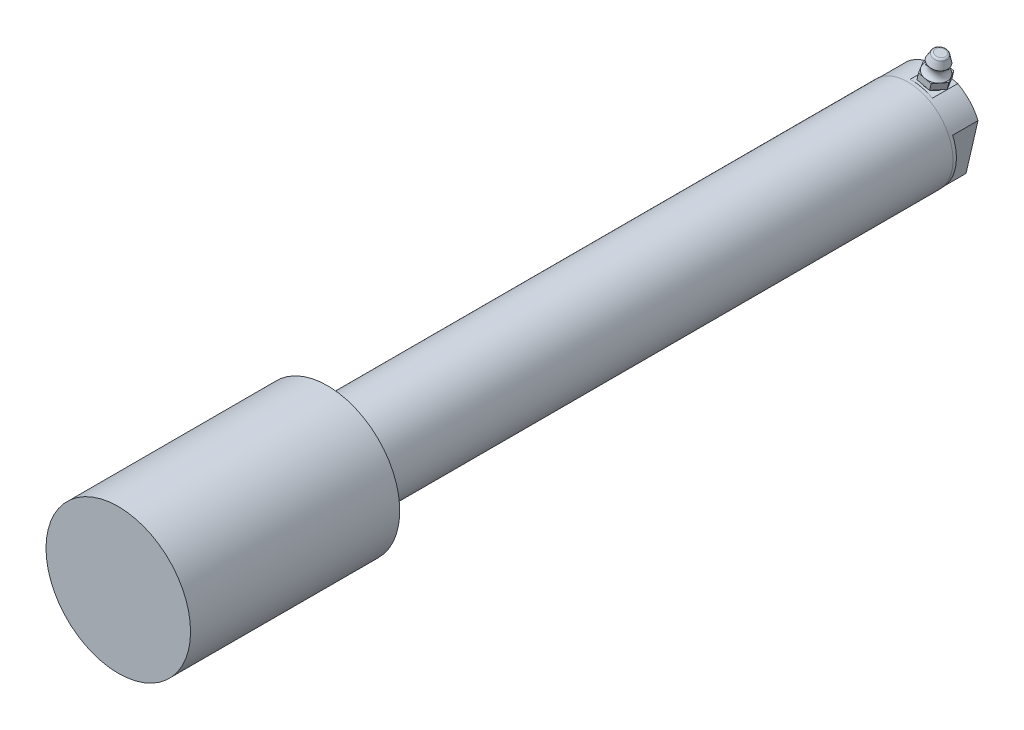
ISO-10303-21;
HEADER;
FILE_DESCRIPTION(('STEP AP214'),'2;1');
FILE_NAME('part.step','',(''),(''),'','','');
FILE_SCHEMA(('AUTOMOTIVE_DESIGN { 1 0 10303 214 1 1 1 1 }'));
ENDSEC;
DATA;
#1=APPLICATION_CONTEXT('core data for automotive mechanical design processes');
#2=APPLICATION_PROTOCOL_DEFINITION('international standard','automotive_design',2000,#1);
#3=PRODUCT_CONTEXT('',#1,'mechanical');
#4=PRODUCT('Part','Part','',(#3));
#5=PRODUCT_RELATED_PRODUCT_CATEGORY('part','',(#4));
#6=PRODUCT_DEFINITION_FORMATION('','',#4);
#7=PRODUCT_DEFINITION_CONTEXT('part definition',#1,'design');
#8=PRODUCT_DEFINITION('design','',#6,#7);
#9=PRODUCT_DEFINITION_SHAPE('','',#8);
#10=(LENGTH_UNIT() NAMED_UNIT(*) SI_UNIT(.MILLI.,.METRE.));
#11=(NAMED_UNIT(*) PLANE_ANGLE_UNIT() SI_UNIT($,.RADIAN.));
#12=(NAMED_UNIT(*) SI_UNIT($,.STERADIAN.) SOLID_ANGLE_UNIT());
#13=UNCERTAINTY_MEASURE_WITH_UNIT(LENGTH_MEASURE(1.E-05),#10,'distance_accuracy_value','');
#14=(GEOMETRIC_REPRESENTATION_CONTEXT(3) GLOBAL_UNCERTAINTY_ASSIGNED_CONTEXT((#13)) GLOBAL_UNIT_ASSIGNED_CONTEXT((#10,
#11,#12)) REPRESENTATION_CONTEXT('',''));
#15=CARTESIAN_POINT('',(0.,0.,0.));
#16=DIRECTION('',(0.,0.,1.));
#17=DIRECTION('',(1.,0.,0.));
#18=AXIS2_PLACEMENT_3D('',#15,#16,#17);
#19=CARTESIAN_POINT('',(2.58904604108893,11.2143904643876,4.445));
#20=DIRECTION('',(0.224951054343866,0.974370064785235,0.));
#21=DIRECTION('',(0.,0.,1.));
#22=AXIS2_PLACEMENT_3D('',#19,#20,#21);
#23=CONICAL_SURFACE('',#22,3.048,0.0447462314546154);
#24=CARTESIAN_POINT('',(3.54610030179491,15.3598479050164,4.445));
#25=DIRECTION('',(-0.224951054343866,-0.974370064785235,0.));
#26=DIRECTION('',(0.,0.,-1.));
#27=AXIS2_PLACEMENT_3D('',#24,#25,#26);
#28=CIRCLE('',#27,3.2385);
#29=CARTESIAN_POINT('',(3.54610030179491,15.3598479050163,7.6835));
#30=VERTEX_POINT('',#29);
#31=EDGE_CURVE('E327',#30,#30,#28,.T.);
#32=CARTESIAN_POINT('',(3.42825406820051,14.849399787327,4.445));
#33=DIRECTION('',(-0.224951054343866,-0.974370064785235,0.));
#34=DIRECTION('',(0.974370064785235,-0.224951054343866,0.));
#35=AXIS2_PLACEMENT_3D('',#32,#33,#34);
#36=CIRCLE('',#35,3.21504291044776);
#37=CARTESIAN_POINT('',(3.42825406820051,14.849399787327,7.66004291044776));
#38=VERTEX_POINT('',#37);
#39=EDGE_CURVE('E10',#38,#38,#36,.T.);
#40=CARTESIAN_POINT('',(3.54610030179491,15.3598479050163,7.6835));
#41=CARTESIAN_POINT('',(3.54487273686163,15.3545307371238,7.68325565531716));
#42=CARTESIAN_POINT('',(3.54364517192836,15.3492135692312,7.68301131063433));
#43=CARTESIAN_POINT('',(3.54119004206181,15.338579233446,7.68252262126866));
#44=CARTESIAN_POINT('',(3.53996247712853,15.3332620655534,7.68227827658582));
#45=CARTESIAN_POINT('',(3.53750734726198,15.3226277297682,7.68178958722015));
#46=CARTESIAN_POINT('',(3.53627978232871,15.3173105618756,7.68154524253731));
#47=CARTESIAN_POINT('',(3.53382465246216,15.3066762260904,7.68105655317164));
#48=CARTESIAN_POINT('',(3.53259708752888,15.3013590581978,7.68081220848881));
#49=CARTESIAN_POINT('',(3.53014195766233,15.2907247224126,7.68032351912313));
#50=CARTESIAN_POINT('',(3.52891439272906,15.28540755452,7.6800791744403));
#51=CARTESIAN_POINT('',(3.52645926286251,15.2747732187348,7.67959048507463));
#52=CARTESIAN_POINT('',(3.52523169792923,15.2694560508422,7.67934614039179));
#53=CARTESIAN_POINT('',(3.52277656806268,15.258821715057,7.67885745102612));
#54=CARTESIAN_POINT('',(3.52154900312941,15.2535045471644,7.67861310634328));
#55=CARTESIAN_POINT('',(3.51909387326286,15.2428702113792,7.67812441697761));
#56=CARTESIAN_POINT('',(3.51786630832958,15.2375530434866,7.67788007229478));
#57=CARTESIAN_POINT('',(3.51541117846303,15.2269187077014,7.6773913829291));
#58=CARTESIAN_POINT('',(3.51418361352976,15.2216015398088,7.67714703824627));
#59=CARTESIAN_POINT('',(3.51172848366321,15.2109672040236,7.6766583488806));
#60=CARTESIAN_POINT('',(3.51050091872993,15.205650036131,7.67641400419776));
#61=CARTESIAN_POINT('',(3.50804578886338,15.1950157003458,7.67592531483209));
#62=CARTESIAN_POINT('',(3.50681822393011,15.1896985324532,7.67568097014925));
#63=CARTESIAN_POINT('',(3.50436309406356,15.179064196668,7.67519228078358));
#64=CARTESIAN_POINT('',(3.50313552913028,15.1737470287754,7.67494793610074));
#65=CARTESIAN_POINT('',(3.50068039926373,15.1631126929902,7.67445924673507));
#66=CARTESIAN_POINT('',(3.49945283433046,15.1577955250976,7.67421490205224));
#67=CARTESIAN_POINT('',(3.49699770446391,15.1471611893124,7.67372621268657));
#68=CARTESIAN_POINT('',(3.49577013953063,15.1418440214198,7.67348186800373));
#69=CARTESIAN_POINT('',(3.49331500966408,15.1312096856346,7.67299317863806));
#70=CARTESIAN_POINT('',(3.49208744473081,15.125892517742,7.67274883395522));
#71=CARTESIAN_POINT('',(3.48963231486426,15.1152581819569,7.67226014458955));
#72=CARTESIAN_POINT('',(3.48840474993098,15.1099410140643,7.67201579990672));
#73=CARTESIAN_POINT('',(3.48594962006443,15.0993066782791,7.67152711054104));
#74=CARTESIAN_POINT('',(3.48472205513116,15.0939895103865,7.67128276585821));
#75=CARTESIAN_POINT('',(3.48226692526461,15.0833551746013,7.67079407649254));
#76=CARTESIAN_POINT('',(3.48103936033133,15.0780380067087,7.6705497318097));
#77=CARTESIAN_POINT('',(3.47858423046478,15.0674036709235,7.67006104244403));
#78=CARTESIAN_POINT('',(3.47735666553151,15.0620865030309,7.66981669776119));
#79=CARTESIAN_POINT('',(3.47490153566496,15.0514521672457,7.66932800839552));
#80=CARTESIAN_POINT('',(3.47367397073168,15.0461349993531,7.66908366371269));
#81=CARTESIAN_POINT('',(3.47121884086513,15.0355006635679,7.66859497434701));
#82=CARTESIAN_POINT('',(3.46999127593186,15.0301834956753,7.66835062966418));
#83=CARTESIAN_POINT('',(3.46753614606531,15.0195491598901,7.66786194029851));
#84=CARTESIAN_POINT('',(3.46630858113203,15.0142319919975,7.66761759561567));
#85=CARTESIAN_POINT('',(3.46385345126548,15.0035976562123,7.66712890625));
#86=CARTESIAN_POINT('',(3.46262588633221,14.9982804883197,7.66688456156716));
#87=CARTESIAN_POINT('',(3.46017075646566,14.9876461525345,7.66639587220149));
#88=CARTESIAN_POINT('',(3.45894319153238,14.9823289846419,7.66615152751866));
#89=CARTESIAN_POINT('',(3.45648806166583,14.9716946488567,7.66566283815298));
#90=CARTESIAN_POINT('',(3.45526049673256,14.9663774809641,7.66541849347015));
#91=CARTESIAN_POINT('',(3.45280536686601,14.9557431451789,7.66492980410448));
#92=CARTESIAN_POINT('',(3.45157780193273,14.9504259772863,7.66468545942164));
#93=CARTESIAN_POINT('',(3.44912267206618,14.9397916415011,7.66419677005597));
#94=CARTESIAN_POINT('',(3.44789510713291,14.9344744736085,7.66395242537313));
#95=CARTESIAN_POINT('',(3.44543997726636,14.9238401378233,7.66346373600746));
#96=CARTESIAN_POINT('',(3.44421241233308,14.9185229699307,7.66321939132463));
#97=CARTESIAN_POINT('',(3.44175728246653,14.9078886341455,7.66273070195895));
#98=CARTESIAN_POINT('',(3.44052971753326,14.9025714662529,7.66248635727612));
#99=CARTESIAN_POINT('',(3.43807458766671,14.8919371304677,7.66199766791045));
#100=CARTESIAN_POINT('',(3.43684702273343,14.8866199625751,7.66175332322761));
#101=CARTESIAN_POINT('',(3.43439189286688,14.8759856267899,7.66126463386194));
#102=CARTESIAN_POINT('',(3.43316432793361,14.8706684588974,7.6610202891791));
#103=CARTESIAN_POINT('',(3.43070919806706,14.8600341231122,7.66053159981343));
#104=CARTESIAN_POINT('',(3.42948163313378,14.8547169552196,7.6602872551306));
#105=CARTESIAN_POINT('',(3.42825406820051,14.849399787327,7.66004291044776));
#106=B_SPLINE_CURVE_WITH_KNOTS('',3,(#40,#41,#42,#43,#44,#45,#46,#47,#48,#49,#50,#51,#52,#53,
#54,#55,#56,#57,#58,#59,#60,#61,#62,#63,#64,#65,#66,#67,#68,#69,#70,#71,#72,#73,#74,#75,#76,#77,
#78,#79,#80,#81,#82,#83,#84,#85,#86,#87,#88,#89,#90,#91,#92,#93,#94,#95,#96,#97,#98,#99,#100,
#101,#102,#103,#104,#105),.UNSPECIFIED.,.F.,.F.,(4,2,2,2,2,2,2,2,2,2,2,2,2,2,2,2,2,2,2,2,2,2,2,
2,2,2,2,2,2,2,2,2,4),(0.,0.0163874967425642,0.03277499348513,0.0491624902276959,
0.0655499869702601,0.081937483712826,0.0983249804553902,0.114712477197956,0.131099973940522,
0.147487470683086,0.163874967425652,0.180262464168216,0.196649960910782,0.213037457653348,
0.229424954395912,0.245812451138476,0.262199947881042,0.278587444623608,0.294974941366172,
0.311362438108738,0.327749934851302,0.344137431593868,0.360524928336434,0.376912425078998,
0.393299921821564,0.409687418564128,0.426074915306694,0.44246241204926,0.458849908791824,
0.47523740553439,0.491624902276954,0.50801239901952,0.524399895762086),.UNSPECIFIED.);
#107=EDGE_CURVE('BSEAM16',#30,#38,#106,.T.);
#108=ORIENTED_EDGE('',*,*,#31,.T.);
#109=ORIENTED_EDGE('',*,*,#39,.F.);
#110=ORIENTED_EDGE('',*,*,#107,.T.);
#111=ORIENTED_EDGE('',*,*,#107,.F.);
#112=EDGE_LOOP('',(#108,#110,#109,#111));
#113=FACE_BOUND('',#112,.T.);
#114=ADVANCED_FACE('F16',(#113),#23,.T.);
#115=CARTESIAN_POINT('',(1.96340863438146,18.6904902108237,0.47625));
#116=DIRECTION('',(0.224951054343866,0.974370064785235,0.));
#117=DIRECTION('',(0.974370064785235,-0.224951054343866,0.));
#118=AXIS2_PLACEMENT_3D('',#115,#116,#117);
#119=PLANE('',#118);
#120=CARTESIAN_POINT('',(4.19604013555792,18.1750466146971,4.445));
#121=DIRECTION('',(-0.224951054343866,-0.974370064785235,0.));
#122=DIRECTION('',(0.,0.,-1.));
#123=AXIS2_PLACEMENT_3D('',#120,#121,#122);
#124=CIRCLE('',#123,3.96875);
#125=CARTESIAN_POINT('',(4.19604013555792,18.1750466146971,8.41375));
#126=VERTEX_POINT('',#125);
#127=CARTESIAN_POINT('',(0.847092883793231,18.9482120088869,6.429375));
#128=VERTEX_POINT('',#127);
#129=EDGE_CURVE('E412',#126,#128,#124,.T.);
#130=ORIENTED_EDGE('',*,*,#129,.T.);
#131=DIRECTION('',(0.487185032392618,-0.112475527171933,0.866025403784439));
#132=VECTOR('',#131,1.);
#133=CARTESIAN_POINT('',(-0.269222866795,19.2059338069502,4.445));
#134=LINE('',#133,#132);
#135=CARTESIAN_POINT('',(1.96340863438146,18.6904902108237,8.41375));
#136=VERTEX_POINT('',#135);
#137=EDGE_CURVE('E390',#128,#136,#134,.T.);
#138=ORIENTED_EDGE('',*,*,#137,.T.);
#139=DIRECTION('',(0.974370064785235,-0.224951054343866,0.));
#140=VECTOR('',#139,1.);
#141=CARTESIAN_POINT('',(1.96340863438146,18.6904902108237,8.41375));
#142=LINE('',#141,#140);
#143=EDGE_CURVE('E394',#136,#126,#142,.T.);
#144=ORIENTED_EDGE('',*,*,#143,.T.);
#145=EDGE_LOOP('',(#130,#138,#144));
#146=FACE_BOUND('',#145,.T.);
#147=ADVANCED_FACE('F269',(#146),#119,.T.);
#148=CARTESIAN_POINT('',(7.54498738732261,17.4018812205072,6.429375));
#149=VERTEX_POINT('',#148);
#150=EDGE_CURVE('E411',#149,#126,#124,.T.);
#151=ORIENTED_EDGE('',*,*,#150,.T.);
#152=CARTESIAN_POINT('',(6.42867163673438,17.6596030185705,8.41375));
#153=VERTEX_POINT('',#152);
#154=EDGE_CURVE('E393',#126,#153,#142,.T.);
#155=ORIENTED_EDGE('',*,*,#154,.T.);
#156=DIRECTION('',(0.487185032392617,-0.112475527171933,-0.866025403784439));
#157=VECTOR('',#156,1.);
#158=CARTESIAN_POINT('',(6.42867163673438,17.6596030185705,8.41375));
#159=LINE('',#158,#157);
#160=EDGE_CURVE('E397',#153,#149,#159,.T.);
#161=ORIENTED_EDGE('',*,*,#160,.T.);
#162=EDGE_LOOP('',(#151,#155,#161));
#163=FACE_BOUND('',#162,.T.);
#164=ADVANCED_FACE('F426',(#163),#119,.T.);
#165=CARTESIAN_POINT('',(7.54498738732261,17.4018812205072,2.460625));
#166=VERTEX_POINT('',#165);
#167=EDGE_CURVE('E94',#166,#149,#124,.T.);
#168=ORIENTED_EDGE('',*,*,#167,.T.);
#169=CARTESIAN_POINT('',(8.66130313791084,17.144159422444,4.445));
#170=VERTEX_POINT('',#169);
#171=EDGE_CURVE('E396',#149,#170,#159,.T.);
#172=ORIENTED_EDGE('',*,*,#171,.T.);
#173=DIRECTION('',(-0.487185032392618,0.112475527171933,-0.866025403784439));
#174=VECTOR('',#173,1.);
#175=CARTESIAN_POINT('',(8.66130313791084,17.144159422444,4.445));
#176=LINE('',#175,#174);
#177=EDGE_CURVE('E335',#170,#166,#176,.T.);
#178=ORIENTED_EDGE('',*,*,#177,.T.);
#179=EDGE_LOOP('',(#168,#172,#178));
#180=FACE_BOUND('',#179,.T.);
#181=ADVANCED_FACE('F404',(#180),#119,.T.);
#182=CARTESIAN_POINT('',(4.19604013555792,18.1750466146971,0.47625));
#183=VERTEX_POINT('',#182);
#184=EDGE_CURVE('E101',#183,#166,#124,.T.);
#185=ORIENTED_EDGE('',*,*,#184,.T.);
#186=CARTESIAN_POINT('',(6.42867163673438,17.6596030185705,0.47625));
#187=VERTEX_POINT('',#186);
#188=EDGE_CURVE('E399',#166,#187,#176,.T.);
#189=ORIENTED_EDGE('',*,*,#188,.T.);
#190=DIRECTION('',(-0.974370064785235,0.224951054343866,0.));
#191=VECTOR('',#190,1.);
#192=CARTESIAN_POINT('',(6.42867163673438,17.6596030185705,0.47625));
#193=LINE('',#192,#191);
#194=EDGE_CURVE('E384',#187,#183,#193,.T.);
#195=ORIENTED_EDGE('',*,*,#194,.T.);
#196=EDGE_LOOP('',(#185,#189,#195));
#197=FACE_BOUND('',#196,.T.);
#198=ADVANCED_FACE('F311',(#197),#119,.T.);
#199=CARTESIAN_POINT('',(0.84709288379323,18.9482120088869,2.460625));
#200=VERTEX_POINT('',#199);
#201=EDGE_CURVE('E380',#200,#183,#124,.T.);
#202=ORIENTED_EDGE('',*,*,#201,.T.);
#203=CARTESIAN_POINT('',(1.96340863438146,18.6904902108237,0.47625));
#204=VERTEX_POINT('',#203);
#205=EDGE_CURVE('E345',#183,#204,#193,.T.);
#206=ORIENTED_EDGE('',*,*,#205,.T.);
#207=DIRECTION('',(-0.487185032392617,0.112475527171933,0.866025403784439));
#208=VECTOR('',#207,1.);
#209=CARTESIAN_POINT('',(1.96340863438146,18.6904902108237,0.47625));
#210=LINE('',#209,#208);
#211=EDGE_CURVE('E387',#204,#200,#210,.T.);
#212=ORIENTED_EDGE('',*,*,#211,.T.);
#213=EDGE_LOOP('',(#202,#206,#212));
#214=FACE_BOUND('',#213,.T.);
#215=ADVANCED_FACE('F282',(#214),#119,.T.);
#216=CARTESIAN_POINT('',(6.42867163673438,17.6596030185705,0.47625));
#217=DIRECTION('',(0.,0.,1.));
#218=DIRECTION('',(-0.224951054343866,-0.974370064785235,0.));
#219=AXIS2_PLACEMENT_3D('',#216,#217,#218);
#220=PLANE('',#219);
#221=DIRECTION('',(-0.974370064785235,0.224951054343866,0.));
#222=VECTOR('',#221,1.);
#223=CARTESIAN_POINT('',(5.89300693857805,15.3393843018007,0.47625));
#224=LINE('',#223,#222);
#225=CARTESIAN_POINT('',(5.89300693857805,15.3393843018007,0.47625));
#226=VERTEX_POINT('',#225);
#227=CARTESIAN_POINT('',(1.42774393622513,16.3702714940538,0.47625));
#228=VERTEX_POINT('',#227);
#229=EDGE_CURVE('E317',#226,#228,#224,.T.);
#230=ORIENTED_EDGE('',*,*,#229,.T.);
#231=DIRECTION('',(-0.224951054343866,-0.974370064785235,0.));
#232=VECTOR('',#231,1.);
#233=CARTESIAN_POINT('',(1.96340863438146,18.6904902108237,0.47625));
#234=LINE('',#233,#232);
#235=EDGE_CURVE('E320',#204,#228,#234,.T.);
#236=ORIENTED_EDGE('',*,*,#235,.F.);
#237=ORIENTED_EDGE('',*,*,#205,.F.);
#238=ORIENTED_EDGE('',*,*,#194,.F.);
#239=DIRECTION('',(-0.224951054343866,-0.974370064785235,0.));
#240=VECTOR('',#239,1.);
#241=CARTESIAN_POINT('',(6.42867163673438,17.6596030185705,0.47625));
#242=LINE('',#241,#240);
#243=EDGE_CURVE('E323',#187,#226,#242,.T.);
#244=ORIENTED_EDGE('',*,*,#243,.T.);
#245=EDGE_LOOP('',(#230,#236,#237,#238,#244));
#246=FACE_BOUND('',#245,.T.);
#247=ADVANCED_FACE('F303',(#246),#220,.F.);
#248=CARTESIAN_POINT('',(1.96340863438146,18.6904902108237,0.47625));
#249=DIRECTION('',(0.843829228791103,-0.194813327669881,0.5));
#250=DIRECTION('',(0.487185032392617,-0.112475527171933,-0.866025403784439));
#251=AXIS2_PLACEMENT_3D('',#248,#249,#250);
#252=PLANE('',#251);
#253=DIRECTION('',(-0.487185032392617,0.112475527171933,0.866025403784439));
#254=VECTOR('',#253,1.);
#255=CARTESIAN_POINT('',(1.42774393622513,16.3702714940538,0.47625));
#256=LINE('',#255,#254);
#257=CARTESIAN_POINT('',(-0.804887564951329,16.8857150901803,4.445));
#258=VERTEX_POINT('',#257);
#259=EDGE_CURVE('E326',#228,#258,#256,.T.);
#260=ORIENTED_EDGE('',*,*,#259,.T.);
#261=DIRECTION('',(-0.224951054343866,-0.974370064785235,0.));
#262=VECTOR('',#261,1.);
#263=CARTESIAN_POINT('',(-0.269222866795,19.2059338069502,4.445));
#264=LINE('',#263,#262);
#265=CARTESIAN_POINT('',(-0.269222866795,19.2059338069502,4.445));
#266=VERTEX_POINT('',#265);
#267=EDGE_CURVE('E356',#266,#258,#264,.T.);
#268=ORIENTED_EDGE('',*,*,#267,.F.);
#269=EDGE_CURVE('E386',#200,#266,#210,.T.);
#270=ORIENTED_EDGE('',*,*,#269,.F.);
#271=ORIENTED_EDGE('',*,*,#211,.F.);
#272=ORIENTED_EDGE('',*,*,#235,.T.);
#273=EDGE_LOOP('',(#260,#268,#270,#271,#272));
#274=FACE_BOUND('',#273,.T.);
#275=ADVANCED_FACE('F300',(#274),#252,.F.);
#276=CARTESIAN_POINT('',(-0.269222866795,19.2059338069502,4.445));
#277=DIRECTION('',(0.843829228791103,-0.194813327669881,-0.5));
#278=DIRECTION('',(-0.487185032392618,0.112475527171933,-0.866025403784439));
#279=AXIS2_PLACEMENT_3D('',#276,#277,#278);
#280=PLANE('',#279);
#281=DIRECTION('',(0.487185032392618,-0.112475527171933,0.866025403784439));
#282=VECTOR('',#281,1.);
#283=CARTESIAN_POINT('',(-0.804887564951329,16.8857150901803,4.445));
#284=LINE('',#283,#282);
#285=CARTESIAN_POINT('',(1.42774393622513,16.3702714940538,8.41375));
#286=VERTEX_POINT('',#285);
#287=EDGE_CURVE('E329',#258,#286,#284,.T.);
#288=ORIENTED_EDGE('',*,*,#287,.T.);
#289=DIRECTION('',(-0.224951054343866,-0.974370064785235,0.));
#290=VECTOR('',#289,1.);
#291=CARTESIAN_POINT('',(1.96340863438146,18.6904902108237,8.41375));
#292=LINE('',#291,#290);
#293=EDGE_CURVE('E353',#136,#286,#292,.T.);
#294=ORIENTED_EDGE('',*,*,#293,.F.);
#295=ORIENTED_EDGE('',*,*,#137,.F.);
#296=EDGE_CURVE('E391',#266,#128,#134,.T.);
#297=ORIENTED_EDGE('',*,*,#296,.F.);
#298=ORIENTED_EDGE('',*,*,#267,.T.);
#299=EDGE_LOOP('',(#288,#294,#295,#297,#298));
#300=FACE_BOUND('',#299,.T.);
#301=ADVANCED_FACE('F296',(#300),#280,.F.);
#302=CARTESIAN_POINT('',(1.96340863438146,18.6904902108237,8.41375));
#303=DIRECTION('',(0.,0.,-1.));
#304=DIRECTION('',(-0.974370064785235,0.224951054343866,0.));
#305=AXIS2_PLACEMENT_3D('',#302,#303,#304);
#306=PLANE('',#305);
#307=DIRECTION('',(0.974370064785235,-0.224951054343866,0.));
#308=VECTOR('',#307,1.);
#309=CARTESIAN_POINT('',(1.42774393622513,16.3702714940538,8.41375));
#310=LINE('',#309,#308);
#311=CARTESIAN_POINT('',(5.89300693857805,15.3393843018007,8.41375));
#312=VERTEX_POINT('',#311);
#313=EDGE_CURVE('E339',#286,#312,#310,.T.);
#314=ORIENTED_EDGE('',*,*,#313,.T.);
#315=DIRECTION('',(-0.224951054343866,-0.974370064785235,0.));
#316=VECTOR('',#315,1.);
#317=CARTESIAN_POINT('',(6.42867163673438,17.6596030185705,8.41375));
#318=LINE('',#317,#316);
#319=EDGE_CURVE('E350',#153,#312,#318,.T.);
#320=ORIENTED_EDGE('',*,*,#319,.F.);
#321=ORIENTED_EDGE('',*,*,#154,.F.);
#322=ORIENTED_EDGE('',*,*,#143,.F.);
#323=ORIENTED_EDGE('',*,*,#293,.T.);
#324=EDGE_LOOP('',(#314,#320,#321,#322,#323));
#325=FACE_BOUND('',#324,.T.);
#326=ADVANCED_FACE('F292',(#325),#306,.F.);
#327=CARTESIAN_POINT('',(6.42867163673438,17.6596030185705,8.41375));
#328=DIRECTION('',(-0.843829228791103,0.194813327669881,-0.5));
#329=DIRECTION('',(-0.487185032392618,0.112475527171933,0.866025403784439));
#330=AXIS2_PLACEMENT_3D('',#327,#328,#329);
#331=PLANE('',#330);
#332=DIRECTION('',(0.487185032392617,-0.112475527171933,-0.866025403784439));
#333=VECTOR('',#332,1.);
#334=CARTESIAN_POINT('',(5.89300693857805,15.3393843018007,8.41375));
#335=LINE('',#334,#333);
#336=CARTESIAN_POINT('',(8.12563843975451,14.8239407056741,4.445));
#337=VERTEX_POINT('',#336);
#338=EDGE_CURVE('E341',#312,#337,#335,.T.);
#339=ORIENTED_EDGE('',*,*,#338,.T.);
#340=DIRECTION('',(-0.224951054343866,-0.974370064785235,0.));
#341=VECTOR('',#340,1.);
#342=CARTESIAN_POINT('',(8.66130313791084,17.144159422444,4.445));
#343=LINE('',#342,#341);
#344=EDGE_CURVE('E347',#170,#337,#343,.T.);
#345=ORIENTED_EDGE('',*,*,#344,.F.);
#346=ORIENTED_EDGE('',*,*,#171,.F.);
#347=ORIENTED_EDGE('',*,*,#160,.F.);
#348=ORIENTED_EDGE('',*,*,#319,.T.);
#349=EDGE_LOOP('',(#339,#345,#346,#347,#348));
#350=FACE_BOUND('',#349,.T.);
#351=ADVANCED_FACE('F288',(#350),#331,.F.);
#352=CARTESIAN_POINT('',(8.66130313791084,17.144159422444,4.445));
#353=DIRECTION('',(-0.843829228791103,0.194813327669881,0.5));
#354=DIRECTION('',(0.487185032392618,-0.112475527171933,0.866025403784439));
#355=AXIS2_PLACEMENT_3D('',#352,#353,#354);
#356=PLANE('',#355);
#357=DIRECTION('',(-0.487185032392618,0.112475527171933,-0.866025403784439));
#358=VECTOR('',#357,1.);
#359=CARTESIAN_POINT('',(8.12563843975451,14.8239407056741,4.445));
#360=LINE('',#359,#358);
#361=EDGE_CURVE('E343',#337,#226,#360,.T.);
#362=ORIENTED_EDGE('',*,*,#361,.T.);
#363=ORIENTED_EDGE('',*,*,#243,.F.);
#364=ORIENTED_EDGE('',*,*,#188,.F.);
#365=ORIENTED_EDGE('',*,*,#177,.F.);
#366=ORIENTED_EDGE('',*,*,#344,.T.);
#367=EDGE_LOOP('',(#362,#363,#364,#365,#366));
#368=FACE_BOUND('',#367,.T.);
#369=ADVANCED_FACE('F280',(#368),#356,.F.);
#370=EDGE_CURVE('E415',#128,#200,#124,.T.);
#371=ORIENTED_EDGE('',*,*,#370,.T.);
#372=ORIENTED_EDGE('',*,*,#269,.T.);
#373=ORIENTED_EDGE('',*,*,#296,.T.);
#374=EDGE_LOOP('',(#371,#372,#373));
#375=FACE_BOUND('',#374,.T.);
#376=ADVANCED_FACE('F277',(#375),#119,.T.);
#377=CARTESIAN_POINT('',(1.42774393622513,16.3702714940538,0.47625));
#378=DIRECTION('',(0.224951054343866,0.974370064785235,0.));
#379=DIRECTION('',(0.974370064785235,-0.224951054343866,0.));
#380=AXIS2_PLACEMENT_3D('',#377,#378,#379);
#381=PLANE('',#380);
#382=CARTESIAN_POINT('',(3.66037543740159,15.8548278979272,4.445));
#383=DIRECTION('',(-0.224951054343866,-0.974370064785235,0.));
#384=DIRECTION('',(0.,0.,-1.));
#385=AXIS2_PLACEMENT_3D('',#382,#383,#384);
#386=CIRCLE('',#385,3.2385);
#387=CARTESIAN_POINT('',(3.66037543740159,15.8548278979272,1.2065));
#388=VERTEX_POINT('',#387);
#389=EDGE_CURVE('E332',#388,#388,#386,.T.);
#390=ORIENTED_EDGE('',*,*,#389,.F.);
#391=EDGE_LOOP('',(#390));
#392=FACE_BOUND('',#391,.T.);
#393=ORIENTED_EDGE('',*,*,#229,.F.);
#394=ORIENTED_EDGE('',*,*,#361,.F.);
#395=ORIENTED_EDGE('',*,*,#338,.F.);
#396=ORIENTED_EDGE('',*,*,#313,.F.);
#397=ORIENTED_EDGE('',*,*,#287,.F.);
#398=ORIENTED_EDGE('',*,*,#259,.F.);
#399=EDGE_LOOP('',(#393,#394,#395,#396,#397,#398));
#400=FACE_BOUND('',#399,.T.);
#401=ADVANCED_FACE('F265',(#392,#400),#381,.F.);
#402=CARTESIAN_POINT('',(3.66037543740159,15.8548278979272,4.445));
#403=DIRECTION('',(-0.224951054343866,-0.974370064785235,0.));
#404=DIRECTION('',(0.,0.,-1.));
#405=AXIS2_PLACEMENT_3D('',#402,#403,#404);
#406=CYLINDRICAL_SURFACE('',#405,3.2385);
#407=ORIENTED_EDGE('',*,*,#389,.T.);
#408=EDGE_LOOP('',(#407));
#409=FACE_BOUND('',#408,.T.);
#410=ORIENTED_EDGE('',*,*,#31,.F.);
#411=EDGE_LOOP('',(#410));
#412=FACE_BOUND('',#411,.T.);
#413=ADVANCED_FACE('F261',(#409,#412),#406,.T.);
#414=CARTESIAN_POINT('',(5.02810596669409,21.7791196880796,4.445));
#415=DIRECTION('',(-0.224951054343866,-0.974370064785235,0.));
#416=DIRECTION('',(0.,0.,-1.));
#417=AXIS2_PLACEMENT_3D('',#414,#415,#416);
#418=CONICAL_SURFACE('',#417,3.3655,0.340381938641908);
#419=CARTESIAN_POINT('',(5.59956971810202,24.2544011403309,4.445));
#420=DIRECTION('',(0.224951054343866,0.974370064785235,0.));
#421=DIRECTION('',(0.,0.,1.));
#422=AXIS2_PLACEMENT_3D('',#419,#420,#421);
#423=CIRCLE('',#422,2.46577800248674);
#424=CARTESIAN_POINT('',(5.59956971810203,24.2544011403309,1.97922199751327));
#425=VERTEX_POINT('',#424);
#426=EDGE_CURVE('E359',#425,#425,#423,.F.);
#427=CARTESIAN_POINT('',(5.02810596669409,21.7791196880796,4.445));
#428=DIRECTION('',(-0.224951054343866,-0.974370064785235,0.));
#429=DIRECTION('',(0.,0.,-1.));
#430=AXIS2_PLACEMENT_3D('',#427,#428,#429);
#431=CIRCLE('',#430,3.3655);
#432=CARTESIAN_POINT('',(5.02810596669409,21.7791196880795,1.0795));
#433=VERTEX_POINT('',#432);
#434=EDGE_CURVE('E377',#433,#433,#431,.T.);
#435=CARTESIAN_POINT('',(5.59956971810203,24.2544011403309,1.97922199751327));
#436=CARTESIAN_POINT('',(5.59361697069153,24.2286169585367,1.96984989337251));
#437=CARTESIAN_POINT('',(5.58766422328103,24.2028327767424,1.96047778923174));
#438=CARTESIAN_POINT('',(5.57575872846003,24.1512644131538,1.94173358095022));
#439=CARTESIAN_POINT('',(5.56980598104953,24.1254802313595,1.93236147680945));
#440=CARTESIAN_POINT('',(5.55790048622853,24.073911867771,1.91361726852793));
#441=CARTESIAN_POINT('',(5.55194773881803,24.0481276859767,1.90424516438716));
#442=CARTESIAN_POINT('',(5.54004224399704,23.9965593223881,1.88550095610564));
#443=CARTESIAN_POINT('',(5.53408949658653,23.9707751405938,1.87612885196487));
#444=CARTESIAN_POINT('',(5.52218400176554,23.9192067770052,1.85738464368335));
#445=CARTESIAN_POINT('',(5.51623125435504,23.893422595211,1.84801253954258));
#446=CARTESIAN_POINT('',(5.50432575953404,23.8418542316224,1.82926833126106));
#447=CARTESIAN_POINT('',(5.49837301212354,23.8160700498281,1.81989622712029));
#448=CARTESIAN_POINT('',(5.48646751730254,23.7645016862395,1.80115201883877));
#449=CARTESIAN_POINT('',(5.48051476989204,23.7387175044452,1.79177991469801));
#450=CARTESIAN_POINT('',(5.46860927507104,23.6871491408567,1.77303570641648));
#451=CARTESIAN_POINT('',(5.46265652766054,23.6613649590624,1.76366360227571));
#452=CARTESIAN_POINT('',(5.45075103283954,23.6097965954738,1.74491939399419));
#453=CARTESIAN_POINT('',(5.44479828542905,23.5840124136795,1.73554728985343));
#454=CARTESIAN_POINT('',(5.43289279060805,23.532444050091,1.7168030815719));
#455=CARTESIAN_POINT('',(5.42694004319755,23.5066598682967,1.70743097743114));
#456=CARTESIAN_POINT('',(5.41503454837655,23.4550915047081,1.68868676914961));
#457=CARTESIAN_POINT('',(5.40908180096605,23.4293073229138,1.67931466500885));
#458=CARTESIAN_POINT('',(5.39717630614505,23.3777389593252,1.66057045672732));
#459=CARTESIAN_POINT('',(5.39122355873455,23.351954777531,1.65119835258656));
#460=CARTESIAN_POINT('',(5.37931806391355,23.3003864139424,1.63245414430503));
#461=CARTESIAN_POINT('',(5.37336531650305,23.2746022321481,1.62308204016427));
#462=CARTESIAN_POINT('',(5.36145982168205,23.2230338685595,1.60433783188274));
#463=CARTESIAN_POINT('',(5.35550707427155,23.1972496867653,1.59496572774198));
#464=CARTESIAN_POINT('',(5.34360157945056,23.1456813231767,1.57622151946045));
#465=CARTESIAN_POINT('',(5.33764883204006,23.1198971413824,1.56684941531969));
#466=CARTESIAN_POINT('',(5.32574333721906,23.0683287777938,1.54810520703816));
#467=CARTESIAN_POINT('',(5.31979058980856,23.0425445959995,1.5387331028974));
#468=CARTESIAN_POINT('',(5.30788509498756,22.990976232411,1.51998889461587));
#469=CARTESIAN_POINT('',(5.30193234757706,22.9651920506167,1.51061679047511));
#470=CARTESIAN_POINT('',(5.29002685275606,22.9136236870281,1.49187258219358));
#471=CARTESIAN_POINT('',(5.28407410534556,22.8878395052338,1.48250047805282));
#472=CARTESIAN_POINT('',(5.27216861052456,22.8362711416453,1.46375626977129));
#473=CARTESIAN_POINT('',(5.26621586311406,22.810486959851,1.45438416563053));
#474=CARTESIAN_POINT('',(5.25431036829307,22.7589185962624,1.435639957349));
#475=CARTESIAN_POINT('',(5.24835762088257,22.7331344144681,1.42626785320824));
#476=CARTESIAN_POINT('',(5.23645212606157,22.6815660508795,1.40752364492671));
#477=CARTESIAN_POINT('',(5.23049937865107,22.6557818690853,1.39815154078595));
#478=CARTESIAN_POINT('',(5.21859388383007,22.6042135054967,1.37940733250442));
#479=CARTESIAN_POINT('',(5.21264113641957,22.5784293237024,1.37003522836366));
#480=CARTESIAN_POINT('',(5.20073564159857,22.5268609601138,1.35129102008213));
#481=CARTESIAN_POINT('',(5.19478289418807,22.5010767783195,1.34191891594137));
#482=CARTESIAN_POINT('',(5.18287739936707,22.449508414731,1.32317470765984));
#483=CARTESIAN_POINT('',(5.17692465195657,22.4237242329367,1.31380260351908));
#484=CARTESIAN_POINT('',(5.16501915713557,22.3721558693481,1.29505839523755));
#485=CARTESIAN_POINT('',(5.15906640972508,22.3463716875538,1.28568629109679));
#486=CARTESIAN_POINT('',(5.14716091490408,22.2948033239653,1.26694208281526));
#487=CARTESIAN_POINT('',(5.14120816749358,22.269019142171,1.2575699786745));
#488=CARTESIAN_POINT('',(5.12930267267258,22.2174507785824,1.23882577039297));
#489=CARTESIAN_POINT('',(5.12334992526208,22.1916665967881,1.22945366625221));
#490=CARTESIAN_POINT('',(5.11144443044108,22.1400982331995,1.21070945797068));
#491=CARTESIAN_POINT('',(5.10549168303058,22.1143140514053,1.20133735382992));
#492=CARTESIAN_POINT('',(5.09358618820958,22.0627456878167,1.1825931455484));
#493=CARTESIAN_POINT('',(5.08763344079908,22.0369615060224,1.17322104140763));
#494=CARTESIAN_POINT('',(5.07572794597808,21.9853931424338,1.15447683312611));
#495=CARTESIAN_POINT('',(5.06977519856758,21.9596089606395,1.14510472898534));
#496=CARTESIAN_POINT('',(5.05786970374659,21.908040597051,1.12636052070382));
#497=CARTESIAN_POINT('',(5.05191695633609,21.8822564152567,1.11698841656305));
#498=CARTESIAN_POINT('',(5.04001146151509,21.8306880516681,1.09824420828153));
#499=CARTESIAN_POINT('',(5.03405871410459,21.8049038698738,1.08887210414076));
#500=CARTESIAN_POINT('',(5.02810596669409,21.7791196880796,1.0795));
#501=B_SPLINE_CURVE_WITH_KNOTS('',3,(#435,#436,#437,#438,#439,#440,#441,#442,#443,#444,#445,
#446,#447,#448,#449,#450,#451,#452,#453,#454,#455,#456,#457,#458,#459,#460,#461,#462,#463,#464,
#465,#466,#467,#468,#469,#470,#471,#472,#473,#474,#475,#476,#477,#478,#479,#480,#481,#482,#483,
#484,#485,#486,#487,#488,#489,#490,#491,#492,#493,#494,#495,#496,#497,#498,#499,#500),
.UNSPECIFIED.,.F.,.F.,(4,2,2,2,2,2,2,2,2,2,2,2,2,2,2,2,2,2,2,2,2,2,2,2,2,2,2,2,2,2,2,2,4),(0.,
0.0842191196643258,0.168438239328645,0.252657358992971,0.336876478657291,0.421095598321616,
0.505314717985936,0.589533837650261,0.673752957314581,0.757972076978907,0.842191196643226,
0.926410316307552,1.01062943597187,1.0948485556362,1.17906767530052,1.26328679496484,
1.34750591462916,1.43172503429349,1.51594415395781,1.60016327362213,1.68438239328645,
1.76860151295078,1.8528206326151,1.93703975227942,2.02125887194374,2.10547799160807,
2.18969711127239,2.27391623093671,2.35813535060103,2.44235447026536,2.52657358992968,
2.610792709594,2.69501182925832),.UNSPECIFIED.);
#502=EDGE_CURVE('BSEAM264',#425,#433,#501,.T.);
#503=ORIENTED_EDGE('',*,*,#426,.T.);
#504=ORIENTED_EDGE('',*,*,#434,.F.);
#505=ORIENTED_EDGE('',*,*,#502,.T.);
#506=ORIENTED_EDGE('',*,*,#502,.F.);
#507=EDGE_LOOP('',(#503,#505,#504,#506));
#508=FACE_BOUND('',#507,.T.);
#509=ADVANCED_FACE('F264',(#508),#418,.T.);
#510=CARTESIAN_POINT('',(5.71375678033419,24.7489996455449,4.445));
#511=DIRECTION('',(0.224951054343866,0.974370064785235,0.));
#512=DIRECTION('',(0.,0.,1.));
#513=AXIS2_PLACEMENT_3D('',#510,#511,#512);
#514=PLANE('',#513);
#515=CARTESIAN_POINT('',(5.71375678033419,24.7489996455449,4.445));
#516=DIRECTION('',(0.224951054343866,0.974370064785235,0.));
#517=DIRECTION('',(0.,0.,1.));
#518=AXIS2_PLACEMENT_3D('',#515,#516,#517);
#519=CIRCLE('',#518,1.7474960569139);
#520=CARTESIAN_POINT('',(5.71375678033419,24.7489996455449,6.1924960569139));
#521=VERTEX_POINT('',#520);
#522=EDGE_CURVE('E20',#521,#521,#519,.T.);
#523=ORIENTED_EDGE('',*,*,#522,.T.);
#524=EDGE_LOOP('',(#523));
#525=FACE_BOUND('',#524,.T.);
#526=ADVANCED_FACE('F259',(#525),#514,.T.);
#527=CARTESIAN_POINT('',(4.66856449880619,20.2217744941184,4.445));
#528=DIRECTION('',(-0.224951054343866,-0.974370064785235,0.));
#529=DIRECTION('',(0.,0.,-1.));
#530=AXIS2_PLACEMENT_3D('',#527,#528,#529);
#531=TOROIDAL_SURFACE('',#530,5.20693450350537,2.43833450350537);
#532=ORIENTED_EDGE('',*,*,#434,.T.);
#533=EDGE_LOOP('',(#532));
#534=FACE_BOUND('',#533,.T.);
#535=ORIENTED_EDGE('',*,*,#184,.F.);
#536=ORIENTED_EDGE('',*,*,#201,.F.);
#537=ORIENTED_EDGE('',*,*,#370,.F.);
#538=ORIENTED_EDGE('',*,*,#129,.F.);
#539=ORIENTED_EDGE('',*,*,#150,.F.);
#540=ORIENTED_EDGE('',*,*,#167,.F.);
#541=EDGE_LOOP('',(#535,#536,#537,#538,#539,#540));
#542=FACE_BOUND('',#541,.T.);
#543=ADVANCED_FACE('F229',(#534,#542),#531,.F.);
#544=CARTESIAN_POINT('',(5.54234407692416,24.0065296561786,4.445));
#545=DIRECTION('',(0.224951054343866,0.974370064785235,0.));
#546=DIRECTION('',(0.,0.,1.));
#547=AXIS2_PLACEMENT_3D('',#544,#545,#546);
#548=TOROIDAL_SURFACE('',#547,1.7474960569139,0.762);
#549=ORIENTED_EDGE('',*,*,#522,.F.);
#550=EDGE_LOOP('',(#549));
#551=FACE_BOUND('',#550,.T.);
#552=ORIENTED_EDGE('',*,*,#426,.F.);
#553=EDGE_LOOP('',(#552));
#554=FACE_BOUND('',#553,.T.);
#555=ADVANCED_FACE('F18',(#551,#554),#548,.T.);
#556=CARTESIAN_POINT('',(0.,0.,32.512));
#557=DIRECTION('',(0.,0.,-1.));
#558=DIRECTION('',(0.224951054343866,0.974370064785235,0.));
#559=AXIS2_PLACEMENT_3D('',#556,#557,#558);
#560=CONICAL_SURFACE('',#559,4.96062,1.02974425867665);
#561=CARTESIAN_POINT('',(0.,0.,35.4926412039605));
#562=VERTEX_POINT('',#561);
#563=VERTEX_LOOP('',#562);
#564=FACE_BOUND('',#563,.T.);
#565=CARTESIAN_POINT('',(0.,0.,32.512));
#566=DIRECTION('',(0.,0.,-1.));
#567=DIRECTION('',(0.224951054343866,0.974370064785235,0.));
#568=AXIS2_PLACEMENT_3D('',#565,#566,#567);
#569=CIRCLE('',#568,4.96062);
#570=CARTESIAN_POINT('',(1.11589669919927,4.83347963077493,32.512));
#571=VERTEX_POINT('',#570);
#572=EDGE_CURVE('E174',#571,#571,#569,.T.);
#573=ORIENTED_EDGE('',*,*,#572,.T.);
#574=EDGE_LOOP('',(#573));
#575=FACE_BOUND('',#574,.T.);
#576=ADVANCED_FACE('F218',(#564,#575),#560,.F.);
#577=CARTESIAN_POINT('',(0.,0.,0.));
#578=DIRECTION('',(0.,0.,-1.));
#579=DIRECTION('',(0.224951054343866,0.974370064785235,0.));
#580=AXIS2_PLACEMENT_3D('',#577,#578,#579);
#581=CYLINDRICAL_SURFACE('',#580,4.96062);
#582=ORIENTED_EDGE('',*,*,#572,.F.);
#583=EDGE_LOOP('',(#582));
#584=FACE_BOUND('',#583,.T.);
#585=CARTESIAN_POINT('',(0.,0.,0.));
#586=DIRECTION('',(0.,0.,-1.));
#587=DIRECTION('',(0.224951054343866,0.974370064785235,0.));
#588=AXIS2_PLACEMENT_3D('',#585,#586,#587);
#589=CIRCLE('',#588,4.96062);
#590=CARTESIAN_POINT('',(1.11589669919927,4.83347963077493,0.));
#591=VERTEX_POINT('',#590);
#592=EDGE_CURVE('E172',#591,#591,#589,.T.);
#593=ORIENTED_EDGE('',*,*,#592,.T.);
#594=EDGE_LOOP('',(#593));
#595=FACE_BOUND('',#594,.T.);
#596=ADVANCED_FACE('F208',(#584,#595),#581,.F.);
#597=CARTESIAN_POINT('',(0.,0.,8.89));
#598=DIRECTION('',(0.,0.,-1.));
#599=DIRECTION('',(0.224951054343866,0.974370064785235,0.));
#600=AXIS2_PLACEMENT_3D('',#597,#598,#599);
#601=PLANE('',#600);
#602=CARTESIAN_POINT('',(0.,0.,8.89));
#603=DIRECTION('',(0.,0.,-1.));
#604=DIRECTION('',(0.224951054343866,0.974370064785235,0.));
#605=AXIS2_PLACEMENT_3D('',#602,#603,#604);
#606=CIRCLE('',#605,15.7607);
#607=CARTESIAN_POINT('',(14.4740255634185,6.23716670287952,8.89));
#608=VERTEX_POINT('',#607);
#609=CARTESIAN_POINT('',(10.2749740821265,-11.9509234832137,8.89));
#610=VERTEX_POINT('',#609);
#611=EDGE_CURVE('E158',#608,#610,#606,.T.);
#612=ORIENTED_EDGE('',*,*,#611,.T.);
#613=DIRECTION('',(0.224951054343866,0.974370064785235,0.));
#614=VECTOR('',#613,1.);
#615=CARTESIAN_POINT('',(10.2749740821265,-11.9509234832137,8.89));
#616=LINE('',#615,#614);
#617=EDGE_CURVE('E144',#610,#608,#616,.T.);
#618=ORIENTED_EDGE('',*,*,#617,.T.);
#619=EDGE_LOOP('',(#612,#618));
#620=FACE_BOUND('',#619,.T.);
#621=ADVANCED_FACE('F206',(#620),#601,.T.);
#622=CARTESIAN_POINT('',(10.2749740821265,-11.9509234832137,8.89));
#623=DIRECTION('',(-0.974370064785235,0.224951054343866,0.));
#624=DIRECTION('',(0.,0.,1.));
#625=AXIS2_PLACEMENT_3D('',#622,#623,#624);
#626=PLANE('',#625);
#627=DIRECTION('',(0.224951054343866,0.974370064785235,0.));
#628=VECTOR('',#627,1.);
#629=CARTESIAN_POINT('',(10.2749740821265,-11.9509234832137,0.));
#630=LINE('',#629,#628);
#631=CARTESIAN_POINT('',(10.2749740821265,-11.9509234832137,0.));
#632=VERTEX_POINT('',#631);
#633=CARTESIAN_POINT('',(14.4740255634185,6.23716670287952,0.));
#634=VERTEX_POINT('',#633);
#635=EDGE_CURVE('E141',#632,#634,#630,.T.);
#636=ORIENTED_EDGE('',*,*,#635,.T.);
#637=DIRECTION('',(0.,0.,-1.));
#638=VECTOR('',#637,1.);
#639=CARTESIAN_POINT('',(14.4740255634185,6.23716670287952,8.89));
#640=LINE('',#639,#638);
#641=EDGE_CURVE('E148',#608,#634,#640,.T.);
#642=ORIENTED_EDGE('',*,*,#641,.F.);
#643=ORIENTED_EDGE('',*,*,#617,.F.);
#644=DIRECTION('',(0.,0.,-1.));
#645=VECTOR('',#644,1.);
#646=CARTESIAN_POINT('',(10.2749740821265,-11.9509234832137,8.89));
#647=LINE('',#646,#645);
#648=EDGE_CURVE('E138',#610,#632,#647,.T.);
#649=ORIENTED_EDGE('',*,*,#648,.T.);
#650=EDGE_LOOP('',(#636,#642,#643,#649));
#651=FACE_BOUND('',#650,.T.);
#652=ADVANCED_FACE('F140',(#651),#626,.F.);
#653=CARTESIAN_POINT('',(0.,0.,8.89));
#654=DIRECTION('',(0.,0.,-1.));
#655=DIRECTION('',(0.224951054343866,0.974370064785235,0.));
#656=AXIS2_PLACEMENT_3D('',#653,#654,#655);
#657=PLANE('',#656);
#658=CARTESIAN_POINT('',(0.,0.,8.89));
#659=DIRECTION('',(0.,0.,-1.));
#660=DIRECTION('',(0.224951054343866,0.974370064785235,0.));
#661=AXIS2_PLACEMENT_3D('',#658,#659,#660);
#662=CIRCLE('',#661,15.7607);
#663=CARTESIAN_POINT('',(-14.4740255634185,-6.23716670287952,8.89));
#664=VERTEX_POINT('',#663);
#665=CARTESIAN_POINT('',(-10.2749740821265,11.9509234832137,8.89));
#666=VERTEX_POINT('',#665);
#667=EDGE_CURVE('E190',#664,#666,#662,.T.);
#668=ORIENTED_EDGE('',*,*,#667,.T.);
#669=DIRECTION('',(-0.224951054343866,-0.974370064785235,0.));
#670=VECTOR('',#669,1.);
#671=CARTESIAN_POINT('',(-14.4740255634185,-6.23716670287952,8.89));
#672=LINE('',#671,#670);
#673=EDGE_CURVE('E186',#666,#664,#672,.T.);
#674=ORIENTED_EDGE('',*,*,#673,.T.);
#675=EDGE_LOOP('',(#668,#674));
#676=FACE_BOUND('',#675,.T.);
#677=ADVANCED_FACE('F216',(#676),#657,.T.);
#678=CARTESIAN_POINT('',(-14.4740255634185,-6.23716670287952,8.89));
#679=DIRECTION('',(0.974370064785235,-0.224951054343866,0.));
#680=DIRECTION('',(0.,0.,-1.));
#681=AXIS2_PLACEMENT_3D('',#678,#679,#680);
#682=PLANE('',#681);
#683=DIRECTION('',(-0.224951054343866,-0.974370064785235,0.));
#684=VECTOR('',#683,1.);
#685=CARTESIAN_POINT('',(-14.4740255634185,-6.23716670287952,0.));
#686=LINE('',#685,#684);
#687=CARTESIAN_POINT('',(-10.2749740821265,11.9509234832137,0.));
#688=VERTEX_POINT('',#687);
#689=CARTESIAN_POINT('',(-14.4740255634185,-6.23716670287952,0.));
#690=VERTEX_POINT('',#689);
#691=EDGE_CURVE('E188',#688,#690,#686,.T.);
#692=ORIENTED_EDGE('',*,*,#691,.T.);
#693=DIRECTION('',(0.,0.,-1.));
#694=VECTOR('',#693,1.);
#695=CARTESIAN_POINT('',(-14.4740255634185,-6.23716670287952,8.89));
#696=LINE('',#695,#694);
#697=EDGE_CURVE('E159',#664,#690,#696,.T.);
#698=ORIENTED_EDGE('',*,*,#697,.F.);
#699=ORIENTED_EDGE('',*,*,#673,.F.);
#700=DIRECTION('',(0.,0.,-1.));
#701=VECTOR('',#700,1.);
#702=CARTESIAN_POINT('',(-10.2749740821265,11.9509234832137,8.89));
#703=LINE('',#702,#701);
#704=EDGE_CURVE('E184',#666,#688,#703,.T.);
#705=ORIENTED_EDGE('',*,*,#704,.T.);
#706=EDGE_LOOP('',(#692,#698,#699,#705));
#707=FACE_BOUND('',#706,.T.);
#708=ADVANCED_FACE('F554',(#707),#682,.F.);
#709=CARTESIAN_POINT('',(-0.486490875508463,15.753189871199,8.89));
#710=DIRECTION('',(0.,0.,-1.));
#711=DIRECTION('',(0.224951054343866,0.974370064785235,0.));
#712=AXIS2_PLACEMENT_3D('',#709,#710,#711);
#713=PLANE('',#712);
#714=CARTESIAN_POINT('',(0.,0.,8.89));
#715=DIRECTION('',(0.,0.,-1.));
#716=DIRECTION('',(0.224951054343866,0.974370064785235,0.));
#717=AXIS2_PLACEMENT_3D('',#714,#715,#716);
#718=CIRCLE('',#717,15.7607);
#719=CARTESIAN_POINT('',(7.34299901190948,13.9456097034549,8.89));
#720=VERTEX_POINT('',#719);
#721=CARTESIAN_POINT('',(-0.486490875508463,15.753189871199,8.89));
#722=VERTEX_POINT('',#721);
#723=EDGE_CURVE('E26',#720,#722,#718,.F.);
#724=ORIENTED_EDGE('',*,*,#723,.F.);
#725=DIRECTION('',(-0.974370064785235,0.224951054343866,0.));
#726=VECTOR('',#725,1.);
#727=CARTESIAN_POINT('',(7.34299901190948,13.9456097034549,8.89));
#728=LINE('',#727,#726);
#729=EDGE_CURVE('E196',#720,#722,#728,.T.);
#730=ORIENTED_EDGE('',*,*,#729,.T.);
#731=EDGE_LOOP('',(#724,#730));
#732=FACE_BOUND('',#731,.T.);
#733=ADVANCED_FACE('F203',(#732),#713,.T.);
#734=CARTESIAN_POINT('',(0.,0.,10.16));
#735=DIRECTION('',(0.,0.,-1.));
#736=DIRECTION('',(0.224951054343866,0.974370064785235,0.));
#737=AXIS2_PLACEMENT_3D('',#734,#735,#736);
#738=CYLINDRICAL_SURFACE('',#737,15.7607);
#739=DIRECTION('',(0.,0.,-1.));
#740=VECTOR('',#739,1.);
#741=CARTESIAN_POINT('',(7.34299901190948,13.9456097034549,8.89));
#742=LINE('',#741,#740);
#743=CARTESIAN_POINT('',(7.34299901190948,13.9456097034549,0.));
#744=VERTEX_POINT('',#743);
#745=EDGE_CURVE('E35',#720,#744,#742,.T.);
#746=ORIENTED_EDGE('',*,*,#745,.F.);
#747=ORIENTED_EDGE('',*,*,#723,.T.);
#748=DIRECTION('',(0.,0.,-1.));
#749=VECTOR('',#748,1.);
#750=CARTESIAN_POINT('',(-0.486490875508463,15.753189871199,8.89));
#751=LINE('',#750,#749);
#752=CARTESIAN_POINT('',(-0.486490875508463,15.753189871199,0.));
#753=VERTEX_POINT('',#752);
#754=EDGE_CURVE('E194',#722,#753,#751,.T.);
#755=ORIENTED_EDGE('',*,*,#754,.T.);
#756=CARTESIAN_POINT('',(0.,0.,0.));
#757=DIRECTION('',(0.,0.,-1.));
#758=DIRECTION('',(0.224951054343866,0.974370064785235,0.));
#759=AXIS2_PLACEMENT_3D('',#756,#757,#758);
#760=CIRCLE('',#759,15.7607);
#761=EDGE_CURVE('E166',#688,#753,#760,.T.);
#762=ORIENTED_EDGE('',*,*,#761,.F.);
#763=ORIENTED_EDGE('',*,*,#704,.F.);
#764=ORIENTED_EDGE('',*,*,#667,.F.);
#765=ORIENTED_EDGE('',*,*,#697,.T.);
#766=EDGE_CURVE('E155',#632,#690,#760,.T.);
#767=ORIENTED_EDGE('',*,*,#766,.F.);
#768=ORIENTED_EDGE('',*,*,#648,.F.);
#769=ORIENTED_EDGE('',*,*,#611,.F.);
#770=ORIENTED_EDGE('',*,*,#641,.T.);
#771=EDGE_CURVE('E157',#744,#634,#760,.T.);
#772=ORIENTED_EDGE('',*,*,#771,.F.);
#773=EDGE_LOOP('',(#746,#747,#755,#762,#763,#764,#765,#767,#768,#769,#770,#772));
#774=FACE_BOUND('',#773,.T.);
#775=CARTESIAN_POINT('',(0.,0.,10.16));
#776=DIRECTION('',(0.,0.,-1.));
#777=DIRECTION('',(0.224951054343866,0.974370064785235,0.));
#778=AXIS2_PLACEMENT_3D('',#775,#776,#777);
#779=CIRCLE('',#778,15.7607);
#780=CARTESIAN_POINT('',(3.54538608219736,15.3567542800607,10.16));
#781=VERTEX_POINT('',#780);
#782=EDGE_CURVE('E165',#781,#781,#779,.T.);
#783=ORIENTED_EDGE('',*,*,#782,.T.);
#784=EDGE_LOOP('',(#783));
#785=FACE_BOUND('',#784,.T.);
#786=ADVANCED_FACE('F162',(#774,#785),#738,.T.);
#787=CARTESIAN_POINT('',(0.,0.,0.));
#788=DIRECTION('',(0.,0.,-1.));
#789=DIRECTION('',(0.224951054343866,0.974370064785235,0.));
#790=AXIS2_PLACEMENT_3D('',#787,#788,#789);
#791=PLANE('',#790);
#792=DIRECTION('',(-0.974370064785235,0.224951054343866,0.));
#793=VECTOR('',#792,1.);
#794=CARTESIAN_POINT('',(7.34299901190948,13.9456097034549,0.));
#795=LINE('',#794,#793);
#796=EDGE_CURVE('E106',#744,#753,#795,.T.);
#797=ORIENTED_EDGE('',*,*,#796,.F.);
#798=ORIENTED_EDGE('',*,*,#771,.T.);
#799=ORIENTED_EDGE('',*,*,#635,.F.);
#800=ORIENTED_EDGE('',*,*,#766,.T.);
#801=ORIENTED_EDGE('',*,*,#691,.F.);
#802=ORIENTED_EDGE('',*,*,#761,.T.);
#803=EDGE_LOOP('',(#797,#798,#799,#800,#801,#802));
#804=FACE_BOUND('',#803,.T.);
#805=ORIENTED_EDGE('',*,*,#592,.F.);
#806=EDGE_LOOP('',(#805));
#807=FACE_BOUND('',#806,.T.);
#808=ADVANCED_FACE('F152',(#804,#807),#791,.T.);
#809=CARTESIAN_POINT('',(7.34299901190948,13.9456097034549,8.89));
#810=DIRECTION('',(-0.224951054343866,-0.974370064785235,0.));
#811=DIRECTION('',(0.,0.,-1.));
#812=AXIS2_PLACEMENT_3D('',#809,#810,#811);
#813=PLANE('',#812);
#814=ORIENTED_EDGE('',*,*,#39,.T.);
#815=EDGE_LOOP('',(#814));
#816=FACE_BOUND('',#815,.T.);
#817=ORIENTED_EDGE('',*,*,#796,.T.);
#818=ORIENTED_EDGE('',*,*,#754,.F.);
#819=ORIENTED_EDGE('',*,*,#729,.F.);
#820=ORIENTED_EDGE('',*,*,#745,.T.);
#821=EDGE_LOOP('',(#817,#818,#819,#820));
#822=FACE_BOUND('',#821,.T.);
#823=ADVANCED_FACE('F204',(#816,#822),#813,.F.);
#824=CARTESIAN_POINT('',(0.,0.,287.6804));
#825=DIRECTION('',(0.,0.,1.));
#826=DIRECTION('',(1.,0.,0.));
#827=AXIS2_PLACEMENT_3D('',#824,#825,#826);
#828=PLANE('',#827);
#829=CARTESIAN_POINT('',(0.,0.,287.6804));
#830=DIRECTION('',(0.,0.,1.));
#831=DIRECTION('',(1.,0.,0.));
#832=AXIS2_PLACEMENT_3D('',#829,#830,#831);
#833=CIRCLE('',#832,25.4);
#834=CARTESIAN_POINT('',(25.4,0.,287.6804));
#835=VERTEX_POINT('',#834);
#836=EDGE_CURVE('E366',#835,#835,#833,.T.);
#837=ORIENTED_EDGE('',*,*,#836,.T.);
#838=EDGE_LOOP('',(#837));
#839=FACE_BOUND('',#838,.T.);
#840=ADVANCED_FACE('F243',(#839),#828,.T.);
#841=CARTESIAN_POINT('',(0.,0.,287.6804));
#842=DIRECTION('',(0.,0.,-1.));
#843=DIRECTION('',(-1.,0.,0.));
#844=AXIS2_PLACEMENT_3D('',#841,#842,#843);
#845=CYLINDRICAL_SURFACE('',#844,25.4);
#846=ORIENTED_EDGE('',*,*,#836,.F.);
#847=EDGE_LOOP('',(#846));
#848=FACE_BOUND('',#847,.T.);
#849=CARTESIAN_POINT('',(0.,0.,214.14486));
#850=DIRECTION('',(0.,0.,-1.));
#851=DIRECTION('',(-1.,0.,0.));
#852=AXIS2_PLACEMENT_3D('',#849,#850,#851);
#853=CIRCLE('',#852,25.4);
#854=CARTESIAN_POINT('',(-25.4,0.,214.14486));
#855=VERTEX_POINT('',#854);
#856=EDGE_CURVE('E363',#855,#855,#853,.T.);
#857=ORIENTED_EDGE('',*,*,#856,.F.);
#858=EDGE_LOOP('',(#857));
#859=FACE_BOUND('',#858,.T.);
#860=ADVANCED_FACE('F241',(#848,#859),#845,.T.);
#861=CARTESIAN_POINT('',(0.,0.,214.14486));
#862=DIRECTION('',(0.,0.,-1.));
#863=DIRECTION('',(-1.,0.,0.));
#864=AXIS2_PLACEMENT_3D('',#861,#862,#863);
#865=PLANE('',#864);
#866=ORIENTED_EDGE('',*,*,#856,.T.);
#867=EDGE_LOOP('',(#866));
#868=FACE_BOUND('',#867,.T.);
#869=CARTESIAN_POINT('',(0.,0.,214.14486));
#870=DIRECTION('',(0.,0.,-1.));
#871=DIRECTION('',(-1.,0.,0.));
#872=AXIS2_PLACEMENT_3D('',#869,#870,#871);
#873=CIRCLE('',#872,15.84071);
#874=CARTESIAN_POINT('',(-15.84071,0.,214.14486));
#875=VERTEX_POINT('',#874);
#876=EDGE_CURVE('E199',#875,#875,#873,.F.);
#877=ORIENTED_EDGE('',*,*,#876,.T.);
#878=EDGE_LOOP('',(#877));
#879=FACE_BOUND('',#878,.T.);
#880=ADVANCED_FACE('F238',(#868,#879),#865,.T.);
#881=CARTESIAN_POINT('',(0.,0.,214.1474));
#882=DIRECTION('',(0.,0.,-1.));
#883=DIRECTION('',(-1.,0.,0.));
#884=AXIS2_PLACEMENT_3D('',#881,#882,#883);
#885=CYLINDRICAL_SURFACE('',#884,15.84071);
#886=ORIENTED_EDGE('',*,*,#876,.F.);
#887=EDGE_LOOP('',(#886));
#888=FACE_BOUND('',#887,.T.);
#889=CARTESIAN_POINT('',(0.,0.,10.16));
#890=DIRECTION('',(0.,0.,-1.));
#891=DIRECTION('',(-1.,0.,0.));
#892=AXIS2_PLACEMENT_3D('',#889,#890,#891);
#893=CIRCLE('',#892,15.84071);
#894=CARTESIAN_POINT('',(-15.84071,0.,10.16));
#895=VERTEX_POINT('',#894);
#896=EDGE_CURVE('E370',#895,#895,#893,.T.);
#897=ORIENTED_EDGE('',*,*,#896,.F.);
#898=EDGE_LOOP('',(#897));
#899=FACE_BOUND('',#898,.T.);
#900=ADVANCED_FACE('F231',(#888,#899),#885,.T.);
#901=CARTESIAN_POINT('',(0.,0.,10.16));
#902=DIRECTION('',(0.,0.,-1.));
#903=DIRECTION('',(-1.,0.,0.));
#904=AXIS2_PLACEMENT_3D('',#901,#902,#903);
#905=PLANE('',#904);
#906=ORIENTED_EDGE('',*,*,#782,.F.);
#907=EDGE_LOOP('',(#906));
#908=FACE_BOUND('',#907,.T.);
#909=ORIENTED_EDGE('',*,*,#896,.T.);
#910=EDGE_LOOP('',(#909));
#911=FACE_BOUND('',#910,.T.);
#912=ADVANCED_FACE('F244',(#908,#911),#905,.T.);
#913=CLOSED_SHELL('',(#114,#147,#164,#181,#198,#215,#247,#275,#301,#326,#351,#369,#376,#401,
#413,#509,#526,#543,#555,#576,#596,#621,#652,#677,#708,#733,#786,#808,#823,#840,#860,#880,#900,#912));
#914=MANIFOLD_SOLID_BREP('B1',#913);
#915=ADVANCED_BREP_SHAPE_REPRESENTATION('',(#18,#914),#14);
#916=SHAPE_DEFINITION_REPRESENTATION(#9,#915);
ENDSEC;
END-ISO-10303-21;
